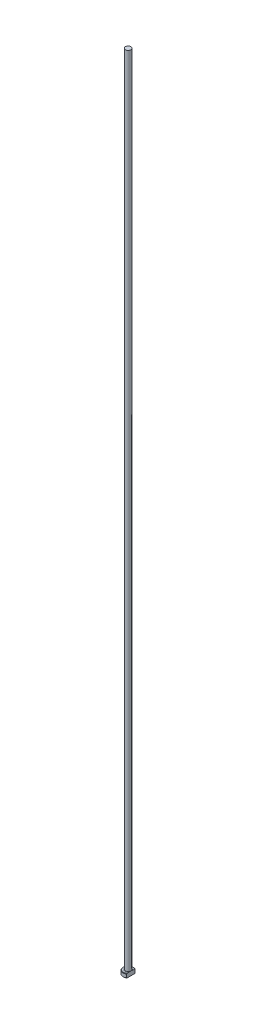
from build123d import *
from build123d.topology import SkipClean

# Parameters (mm, degrees)
CHAMFER1_SIZE = 0.2
FILLET1_R     = 0.2
KEY_DEPTH     = 401.015624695


with BuildPart() as part:
    # Sketch1 → Revolve1 (revolve)
    with BuildSketch(Plane.XY, mode=Mode.PRIVATE) as revolve1_sk:
        Polygon((0, 0), (-2.5, 0), (-2.5, 2), (-1.35, 2), (-1.35, 400), (0, 400), align=None)
    revolve(revolve1_sk.sketch.rotate(Axis((0, 259.958771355, 0), (0, -1, 0)), 270), axis=Axis((0, 259.958771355, 0), (0, -1, 0)))

    # Chamfer1
    chamfer1_edges = [part.edges().sort_by_distance(p)[0] for p in [
        (0, 2, -2.5),
        (0, 0, -2.5),
    ]]
    chamfer(chamfer1_edges, length=CHAMFER1_SIZE)

    # Fillet1
    fillet1_edges = [part.edges().sort_by_distance(p)[0] for p in [
        (0, 2, -1.35),
    ]]
    fillet(fillet1_edges, radius=FILLET1_R)

    # Sketch2 → KEY (cut, through all)
    with SkipClean():  # the faces are left unmerged after this step: merging them gives an invalid solid
        with BuildSketch(Plane(origin=(0, 0, 0), x_dir=(1, 0, 0), z_dir=(0, 1, 0))):
            with BuildLine():
                Line((1.35, 2.104162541), (1.35, -2.104162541))
                ThreePointArc((1.35, -2.104162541), (2.5, 0), (1.35, 2.104162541))
            make_face()
        extrude(amount=KEY_DEPTH, mode=Mode.SUBTRACT)


solid = part.part
